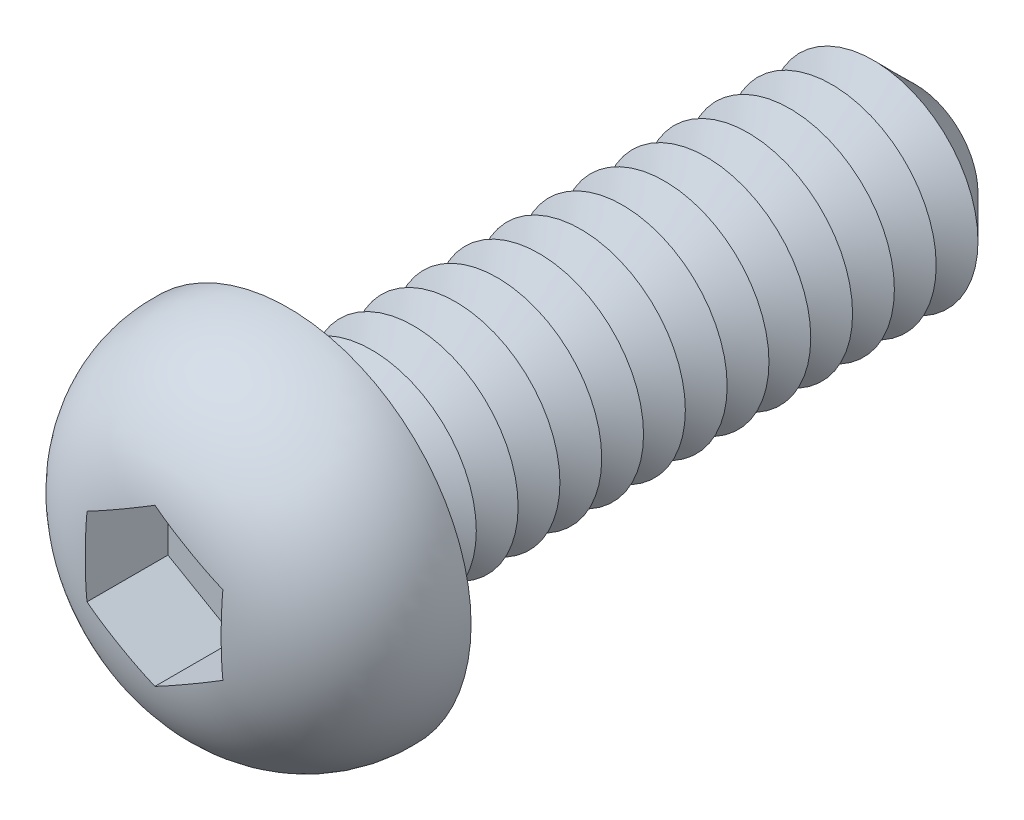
ISO-10303-21;
HEADER;
FILE_DESCRIPTION(('STEP AP214'),'2;1');
FILE_NAME('part.step','',(''),(''),'','','');
FILE_SCHEMA(('AUTOMOTIVE_DESIGN { 1 0 10303 214 1 1 1 1 }'));
ENDSEC;
DATA;
#1=APPLICATION_CONTEXT('core data for automotive mechanical design processes');
#2=APPLICATION_PROTOCOL_DEFINITION('international standard','automotive_design',2000,#1);
#3=PRODUCT_CONTEXT('',#1,'mechanical');
#4=PRODUCT('Part','Part','',(#3));
#5=PRODUCT_RELATED_PRODUCT_CATEGORY('part','',(#4));
#6=PRODUCT_DEFINITION_FORMATION('','',#4);
#7=PRODUCT_DEFINITION_CONTEXT('part definition',#1,'design');
#8=PRODUCT_DEFINITION('design','',#6,#7);
#9=PRODUCT_DEFINITION_SHAPE('','',#8);
#10=(LENGTH_UNIT() NAMED_UNIT(*) SI_UNIT(.MILLI.,.METRE.));
#11=(NAMED_UNIT(*) PLANE_ANGLE_UNIT() SI_UNIT($,.RADIAN.));
#12=(NAMED_UNIT(*) SI_UNIT($,.STERADIAN.) SOLID_ANGLE_UNIT());
#13=UNCERTAINTY_MEASURE_WITH_UNIT(LENGTH_MEASURE(1.E-05),#10,'distance_accuracy_value','');
#14=(GEOMETRIC_REPRESENTATION_CONTEXT(3) GLOBAL_UNCERTAINTY_ASSIGNED_CONTEXT((#13)) GLOBAL_UNIT_ASSIGNED_CONTEXT((#10,
#11,#12)) REPRESENTATION_CONTEXT('',''));
#15=CARTESIAN_POINT('',(0.,0.,0.));
#16=DIRECTION('',(0.,0.,1.));
#17=DIRECTION('',(1.,0.,0.));
#18=AXIS2_PLACEMENT_3D('',#15,#16,#17);
#19=CARTESIAN_POINT('',(0.,0.,-6.));
#20=DIRECTION('',(0.,0.,1.));
#21=DIRECTION('',(1.,0.,0.));
#22=AXIS2_PLACEMENT_3D('',#19,#20,#21);
#23=CYLINDRICAL_SURFACE('',#22,1.);
#24=CARTESIAN_POINT('',(0.,0.,-0.2));
#25=DIRECTION('',(0.,0.,1.));
#26=DIRECTION('',(1.,0.,0.));
#27=AXIS2_PLACEMENT_3D('',#24,#25,#26);
#28=CIRCLE('',#27,1.);
#29=CARTESIAN_POINT('',(1.,0.,-0.2));
#30=VERTEX_POINT('',#29);
#31=EDGE_CURVE('E48',#30,#30,#28,.F.);
#32=ORIENTED_EDGE('',*,*,#31,.T.);
#33=EDGE_LOOP('',(#32));
#34=FACE_BOUND('',#33,.T.);
#35=CARTESIAN_POINT('',(0.,0.,-0.399999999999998));
#36=DIRECTION('',(0.,0.,1.));
#37=DIRECTION('',(1.,0.,0.));
#38=AXIS2_PLACEMENT_3D('',#35,#36,#37);
#39=CIRCLE('',#38,1.);
#40=CARTESIAN_POINT('',(1.,0.,-0.399999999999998));
#41=VERTEX_POINT('',#40);
#42=EDGE_CURVE('E118',#41,#41,#39,.T.);
#43=ORIENTED_EDGE('',*,*,#42,.T.);
#44=EDGE_LOOP('',(#43));
#45=FACE_BOUND('',#44,.T.);
#46=ADVANCED_FACE('F39',(#34,#45),#23,.T.);
#47=CARTESIAN_POINT('',(0.,1.75,0.));
#48=DIRECTION('',(0.,0.,1.));
#49=DIRECTION('',(1.,0.,0.));
#50=AXIS2_PLACEMENT_3D('',#47,#48,#49);
#51=PLANE('',#50);
#52=CARTESIAN_POINT('',(0.,0.,0.));
#53=DIRECTION('',(0.,0.,1.));
#54=DIRECTION('',(1.,0.,0.));
#55=AXIS2_PLACEMENT_3D('',#52,#53,#54);
#56=CIRCLE('',#55,1.2);
#57=CARTESIAN_POINT('',(1.2,0.,0.));
#58=VERTEX_POINT('',#57);
#59=EDGE_CURVE('E11',#58,#58,#56,.T.);
#60=ORIENTED_EDGE('',*,*,#59,.T.);
#61=EDGE_LOOP('',(#60));
#62=FACE_BOUND('',#61,.T.);
#63=CARTESIAN_POINT('',(0.,0.,0.));
#64=DIRECTION('',(0.,0.,1.));
#65=DIRECTION('',(1.,0.,0.));
#66=AXIS2_PLACEMENT_3D('',#63,#64,#65);
#67=CIRCLE('',#66,1.75);
#68=CARTESIAN_POINT('',(1.75,0.,0.));
#69=VERTEX_POINT('',#68);
#70=EDGE_CURVE('E141',#69,#69,#67,.T.);
#71=ORIENTED_EDGE('',*,*,#70,.F.);
#72=EDGE_LOOP('',(#71));
#73=FACE_BOUND('',#72,.T.);
#74=ADVANCED_FACE('F217',(#62,#73),#51,.F.);
#75=CARTESIAN_POINT('',(0.,0.,0.0499999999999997));
#76=DIRECTION('',(0.,0.,1.));
#77=DIRECTION('',(1.,0.,0.));
#78=AXIS2_PLACEMENT_3D('',#75,#76,#77);
#79=DEGENERATE_TOROIDAL_SURFACE('',#78,0.50100040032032,1.25,.T.);
#80=CARTESIAN_POINT('',(-0.6502,0.375162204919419,1.2748120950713));
#81=CARTESIAN_POINT('',(-0.623166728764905,0.390769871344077,1.27799168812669));
#82=CARTESIAN_POINT('',(-0.596087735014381,0.406403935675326,1.28057383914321));
#83=CARTESIAN_POINT('',(-0.541883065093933,0.437699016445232,1.28476453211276));
#84=CARTESIAN_POINT('',(-0.514757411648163,0.453360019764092,1.28637345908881));
#85=CARTESIAN_POINT('',(-0.460533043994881,0.484666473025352,1.288838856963));
#86=CARTESIAN_POINT('',(-0.433434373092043,0.500311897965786,1.28969671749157));
#87=CARTESIAN_POINT('',(-0.379223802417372,0.531610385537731,1.29082127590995));
#88=CARTESIAN_POINT('',(-0.352111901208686,0.547263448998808,1.29108787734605));
#89=CARTESIAN_POINT('',(-0.297888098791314,0.578569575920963,1.29108787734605));
#90=CARTESIAN_POINT('',(-0.270776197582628,0.59422263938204,1.29082127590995));
#91=CARTESIAN_POINT('',(-0.216565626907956,0.625521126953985,1.28969671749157));
#92=CARTESIAN_POINT('',(-0.189466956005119,0.641166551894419,1.288838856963));
#93=CARTESIAN_POINT('',(-0.135242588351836,0.672473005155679,1.28637345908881));
#94=CARTESIAN_POINT('',(-0.108116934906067,0.688134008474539,1.28476453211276));
#95=CARTESIAN_POINT('',(-0.0539122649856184,0.719429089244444,1.28057383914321));
#96=CARTESIAN_POINT('',(-0.0268332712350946,0.735063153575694,1.27799168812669));
#97=CARTESIAN_POINT('',(0.000200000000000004,0.750670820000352,1.2748120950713));
#98=B_SPLINE_CURVE_WITH_KNOTS('',3,(#80,#81,#82,#83,#84,#85,#86,#87,#88,#89,#90,#91,#92,#93,#94,
#95,#96,#97),.UNSPECIFIED.,.F.,.F.,(4,2,2,2,2,2,2,2,4),(0.,0.0941133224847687,0.188189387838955,
0.282091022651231,0.376007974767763,0.469924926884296,0.563826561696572,0.657902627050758,
0.752015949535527),.UNSPECIFIED.);
#99=CARTESIAN_POINT('',(-0.65,0.375277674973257,1.27483563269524));
#100=VERTEX_POINT('',#99);
#101=CARTESIAN_POINT('',(0.,0.750555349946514,1.27483563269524));
#102=VERTEX_POINT('',#101);
#103=EDGE_CURVE('E158',#100,#102,#98,.T.);
#104=ORIENTED_EDGE('',*,*,#103,.T.);
#105=CARTESIAN_POINT('',(-0.000199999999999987,0.750670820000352,1.2748120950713));
#106=CARTESIAN_POINT('',(0.0268332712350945,0.735063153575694,1.27799168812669));
#107=CARTESIAN_POINT('',(0.0539122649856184,0.719429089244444,1.28057383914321));
#108=CARTESIAN_POINT('',(0.108116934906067,0.688134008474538,1.28476453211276));
#109=CARTESIAN_POINT('',(0.135242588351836,0.672473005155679,1.28637345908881));
#110=CARTESIAN_POINT('',(0.189466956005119,0.641166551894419,1.288838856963));
#111=CARTESIAN_POINT('',(0.216565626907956,0.625521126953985,1.28969671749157));
#112=CARTESIAN_POINT('',(0.270776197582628,0.59422263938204,1.29082127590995));
#113=CARTESIAN_POINT('',(0.297888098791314,0.578569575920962,1.29108787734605));
#114=CARTESIAN_POINT('',(0.352111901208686,0.547263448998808,1.29108787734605));
#115=CARTESIAN_POINT('',(0.379223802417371,0.531610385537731,1.29082127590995));
#116=CARTESIAN_POINT('',(0.433434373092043,0.500311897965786,1.28969671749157));
#117=CARTESIAN_POINT('',(0.46053304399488,0.484666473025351,1.288838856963));
#118=CARTESIAN_POINT('',(0.514757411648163,0.453360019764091,1.28637345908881));
#119=CARTESIAN_POINT('',(0.541883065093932,0.437699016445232,1.28476453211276));
#120=CARTESIAN_POINT('',(0.596087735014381,0.406403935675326,1.28057383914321));
#121=CARTESIAN_POINT('',(0.623166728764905,0.390769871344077,1.27799168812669));
#122=CARTESIAN_POINT('',(0.6502,0.375162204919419,1.2748120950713));
#123=B_SPLINE_CURVE_WITH_KNOTS('',3,(#105,#106,#107,#108,#109,#110,#111,#112,#113,#114,#115,
#116,#117,#118,#119,#120,#121,#122),.UNSPECIFIED.,.F.,.F.,(4,2,2,2,2,2,2,2,4),(0.,
0.0941133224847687,0.188189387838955,0.282091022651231,0.376007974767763,0.469924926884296,
0.563826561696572,0.657902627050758,0.752015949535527),.UNSPECIFIED.);
#124=CARTESIAN_POINT('',(0.65,0.375277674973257,1.27483563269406));
#125=VERTEX_POINT('',#124);
#126=EDGE_CURVE('E98',#102,#125,#123,.T.);
#127=ORIENTED_EDGE('',*,*,#126,.T.);
#128=CARTESIAN_POINT('',(0.65,0.,1.29108787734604));
#129=CARTESIAN_POINT('',(0.65,-0.0548046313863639,1.29109436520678));
#130=CARTESIAN_POINT('',(0.65,-0.109608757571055,1.29030350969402));
#131=CARTESIAN_POINT('',(0.65,-0.219170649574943,1.28661520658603));
#132=CARTESIAN_POINT('',(0.65,-0.273928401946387,1.28371727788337));
#133=CARTESIAN_POINT('',(0.65,-0.383095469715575,1.27460340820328));
#134=CARTESIAN_POINT('',(0.65,-0.437505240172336,1.26839356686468));
#135=CARTESIAN_POINT('',(0.65,-0.545599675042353,1.25147686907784));
#136=CARTESIAN_POINT('',(0.65,-0.599284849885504,1.24077336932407));
#137=CARTESIAN_POINT('',(0.65,-0.726147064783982,1.20871234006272));
#138=CARTESIAN_POINT('',(0.65,-0.79872007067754,1.18482363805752));
#139=CARTESIAN_POINT('',(0.65,-0.939044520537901,1.12544321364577));
#140=CARTESIAN_POINT('',(0.65,-1.00679500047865,1.08994917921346));
#141=CARTESIAN_POINT('',(0.65,-1.13535055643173,1.00723279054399));
#142=CARTESIAN_POINT('',(0.65,-1.19611172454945,0.959941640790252));
#143=CARTESIAN_POINT('',(0.65,-1.30775435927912,0.854818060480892));
#144=CARTESIAN_POINT('',(0.65,-1.35863681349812,0.796986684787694));
#145=CARTESIAN_POINT('',(0.65,-1.44408820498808,0.678594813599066));
#146=CARTESIAN_POINT('',(0.65,-1.4797502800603,0.618820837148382));
#147=CARTESIAN_POINT('',(0.65,-1.53998909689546,0.493937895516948));
#148=CARTESIAN_POINT('',(0.65,-1.56457069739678,0.428831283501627));
#149=CARTESIAN_POINT('',(0.65,-1.60096350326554,0.298259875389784));
#150=CARTESIAN_POINT('',(0.65,-1.61329238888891,0.232938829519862));
#151=CARTESIAN_POINT('',(0.65,-1.62664623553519,0.101147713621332));
#152=CARTESIAN_POINT('',(0.65,-1.6276715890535,0.0346776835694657));
#153=CARTESIAN_POINT('',(0.65,-1.6184464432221,-0.0965779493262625));
#154=CARTESIAN_POINT('',(0.65,-1.60834630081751,-0.161374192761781));
#155=CARTESIAN_POINT('',(0.65,-1.57743533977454,-0.288341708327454));
#156=CARTESIAN_POINT('',(0.65,-1.55662692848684,-0.350513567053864));
#157=CARTESIAN_POINT('',(0.65,-1.50490327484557,-0.470651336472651));
#158=CARTESIAN_POINT('',(0.65,-1.47396668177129,-0.528608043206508));
#159=CARTESIAN_POINT('',(0.65,-1.40295285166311,-0.63865943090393));
#160=CARTESIAN_POINT('',(0.65,-1.36286988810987,-0.690750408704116));
#161=CARTESIAN_POINT('',(0.65,-1.27395593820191,-0.788697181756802));
#162=CARTESIAN_POINT('',(0.65,-1.22497034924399,-0.834412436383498));
#163=CARTESIAN_POINT('',(0.65,-1.12042496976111,-0.917345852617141));
#164=CARTESIAN_POINT('',(0.65,-1.06487498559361,-0.954576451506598));
#165=CARTESIAN_POINT('',(0.65,-0.945822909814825,-1.02180899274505));
#166=CARTESIAN_POINT('',(0.65,-0.882060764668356,-1.05135028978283));
#167=CARTESIAN_POINT('',(0.65,-0.783687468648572,-1.08845195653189));
#168=CARTESIAN_POINT('',(0.65,-0.750379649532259,-1.09963089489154));
#169=CARTESIAN_POINT('',(0.65,-0.683093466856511,-1.11968224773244));
#170=CARTESIAN_POINT('',(0.65,-0.64911549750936,-1.12855597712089));
#171=CARTESIAN_POINT('',(0.65,-0.573025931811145,-1.14591124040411));
#172=CARTESIAN_POINT('',(0.65,-0.530794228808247,-1.15386155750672));
#173=CARTESIAN_POINT('',(0.65,-0.445896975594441,-1.16700727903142));
#174=CARTESIAN_POINT('',(0.65,-0.40323122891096,-1.17220137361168));
#175=CARTESIAN_POINT('',(0.65,-0.317562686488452,-1.18041063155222));
#176=CARTESIAN_POINT('',(0.65,-0.274559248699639,-1.18341875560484));
#177=CARTESIAN_POINT('',(0.65,-0.188468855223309,-1.18783962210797));
#178=CARTESIAN_POINT('',(0.65,-0.145381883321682,-1.1892520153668));
#179=CARTESIAN_POINT('',(0.65,-0.0590019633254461,-1.19095450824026));
#180=CARTESIAN_POINT('',(0.65,-0.0157089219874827,-1.19123978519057));
#181=CARTESIAN_POINT('',(0.65,0.0708684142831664,-1.1907952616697));
#182=CARTESIAN_POINT('',(0.65,0.114152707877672,-1.19006535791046));
#183=CARTESIAN_POINT('',(0.65,0.243756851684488,-1.18593769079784));
#184=CARTESIAN_POINT('',(0.65,0.330069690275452,-1.18060873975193));
#185=CARTESIAN_POINT('',(0.65,0.455654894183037,-1.16558903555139));
#186=CARTESIAN_POINT('',(0.65,0.495371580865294,-1.1597609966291));
#187=CARTESIAN_POINT('',(0.65,0.574346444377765,-1.14554740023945));
#188=CARTESIAN_POINT('',(0.65,0.613604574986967,-1.13716158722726));
#189=CARTESIAN_POINT('',(0.65,0.729813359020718,-1.10777161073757));
#190=CARTESIAN_POINT('',(0.65,0.805761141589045,-1.0824785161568));
#191=CARTESIAN_POINT('',(0.65,0.953092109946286,-1.01876094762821));
#192=CARTESIAN_POINT('',(0.65,1.02440985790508,-0.980183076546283));
#193=CARTESIAN_POINT('',(0.65,1.15871394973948,-0.890064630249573));
#194=CARTESIAN_POINT('',(0.65,1.22167627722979,-0.838487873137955));
#195=CARTESIAN_POINT('',(0.65,1.330165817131,-0.729868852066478));
#196=CARTESIAN_POINT('',(0.649999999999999,1.37682604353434,-0.673955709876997));
#197=CARTESIAN_POINT('',(0.649999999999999,1.45915796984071,-0.554638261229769));
#198=CARTESIAN_POINT('',(0.649999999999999,1.49484555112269,-0.491244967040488));
#199=CARTESIAN_POINT('',(0.649999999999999,1.55177809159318,-0.363813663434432));
#200=CARTESIAN_POINT('',(0.649999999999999,1.57388655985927,-0.300159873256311));
#201=CARTESIAN_POINT('',(0.649999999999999,1.60682450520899,-0.169982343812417));
#202=CARTESIAN_POINT('',(0.649999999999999,1.61765327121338,-0.103458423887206));
#203=CARTESIAN_POINT('',(0.649999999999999,1.62754441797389,0.0288862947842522));
#204=CARTESIAN_POINT('',(0.649999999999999,1.6268761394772,0.0946871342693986));
#205=CARTESIAN_POINT('',(0.649999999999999,1.61445465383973,0.225228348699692));
#206=CARTESIAN_POINT('',(0.649999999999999,1.60270257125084,0.289968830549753));
#207=CARTESIAN_POINT('',(0.649999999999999,1.56855547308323,0.416311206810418));
#208=CARTESIAN_POINT('',(0.649999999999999,1.54620091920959,0.477924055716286));
#209=CARTESIAN_POINT('',(0.649999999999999,1.49157336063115,0.596573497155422));
#210=CARTESIAN_POINT('',(0.649999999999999,1.459300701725,0.6536102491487));
#211=CARTESIAN_POINT('',(0.649999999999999,1.38544036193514,0.762206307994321));
#212=CARTESIAN_POINT('',(0.65,1.34375441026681,0.813698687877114));
#213=CARTESIAN_POINT('',(0.65,1.25257593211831,0.909229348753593));
#214=CARTESIAN_POINT('',(0.65,1.20308164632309,0.953265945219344));
#215=CARTESIAN_POINT('',(0.65,1.09600377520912,1.03435686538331));
#216=CARTESIAN_POINT('',(0.65,1.0382019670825,1.07112203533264));
#217=CARTESIAN_POINT('',(0.65,0.917680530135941,1.13527918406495));
#218=CARTESIAN_POINT('',(0.65,0.854963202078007,1.16267551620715));
#219=CARTESIAN_POINT('',(0.65,0.743153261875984,1.20242953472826));
#220=CARTESIAN_POINT('',(0.65,0.69477028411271,1.21684578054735));
#221=CARTESIAN_POINT('',(0.65,0.596867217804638,1.24115086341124));
#222=CARTESIAN_POINT('',(0.65,0.547346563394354,1.25103739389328));
#223=CARTESIAN_POINT('',(0.65,0.397729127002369,1.27492295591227));
#224=CARTESIAN_POINT('',(0.65,0.296733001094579,1.28309757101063));
#225=CARTESIAN_POINT('',(0.65,0.163130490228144,1.28863783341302));
#226=CARTESIAN_POINT('',(0.65,0.130510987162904,1.28957449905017));
#227=CARTESIAN_POINT('',(0.65,0.0652609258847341,1.29079749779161));
#228=CARTESIAN_POINT('',(0.65,0.0326303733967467,1.29108401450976));
#229=CARTESIAN_POINT('',(0.65,0.,1.29108787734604));
#230=B_SPLINE_CURVE_WITH_KNOTS('',3,(#128,#129,#130,#131,#132,#133,#134,#135,#136,#137,#138,
#139,#140,#141,#142,#143,#144,#145,#146,#147,#148,#149,#150,#151,#152,#153,#154,#155,#156,#157,
#158,#159,#160,#161,#162,#163,#164,#165,#166,#167,#168,#169,#170,#171,#172,#173,#174,#175,#176,
#177,#178,#179,#180,#181,#182,#183,#184,#185,#186,#187,#188,#189,#190,#191,#192,#193,#194,#195,
#196,#197,#198,#199,#200,#201,#202,#203,#204,#205,#206,#207,#208,#209,#210,#211,#212,#213,#214,
#215,#216,#217,#218,#219,#220,#221,#222,#223,#224,#225,#226,#227,#228,#229),.UNSPECIFIED.,.T.,
.F.,(4,2,2,2,2,2,2,2,2,2,2,2,2,2,2,2,2,2,2,2,2,2,2,2,2,2,2,2,2,2,2,2,2,2,2,2,2,2,2,2,2,2,2,2,2,
2,2,2,2,2,4),(0.,0.164404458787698,0.328846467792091,0.492986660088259,0.657004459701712,
0.885283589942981,1.11360822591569,1.34329681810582,1.57296243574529,1.78072081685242,
1.9883880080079,2.18685176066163,2.38530862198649,2.58111595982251,2.77687929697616,
2.97305799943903,3.16935986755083,3.36946935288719,3.5692835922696,3.77920028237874,
3.88453412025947,3.98980774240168,4.11861722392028,4.24748786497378,4.37677168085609,
4.50608378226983,4.63594858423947,4.76582660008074,5.02485743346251,5.14520715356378,
5.26556890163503,5.5046106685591,5.74651068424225,5.98909160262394,6.20640136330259,
6.42339510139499,6.62456294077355,6.82574346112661,7.02221748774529,7.21867158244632,
7.41438191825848,7.61008543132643,7.80793510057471,8.00582941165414,8.21046898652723,
8.41501334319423,8.56624321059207,8.71754999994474,9.02064941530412,9.11856257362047,
9.21644807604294),.UNSPECIFIED.);
#231=CARTESIAN_POINT('',(0.65,-0.375277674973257,1.27483563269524));
#232=VERTEX_POINT('',#231);
#233=EDGE_CURVE('E63',#125,#232,#230,.T.);
#234=ORIENTED_EDGE('',*,*,#233,.T.);
#235=CARTESIAN_POINT('',(0.6502,-0.375162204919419,1.2748120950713));
#236=CARTESIAN_POINT('',(0.623166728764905,-0.390769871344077,1.27799168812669));
#237=CARTESIAN_POINT('',(0.596087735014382,-0.406403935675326,1.28057383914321));
#238=CARTESIAN_POINT('',(0.541883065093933,-0.437699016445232,1.28476453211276));
#239=CARTESIAN_POINT('',(0.514757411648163,-0.453360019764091,1.28637345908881));
#240=CARTESIAN_POINT('',(0.460533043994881,-0.484666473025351,1.288838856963));
#241=CARTESIAN_POINT('',(0.433434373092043,-0.500311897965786,1.28969671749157));
#242=CARTESIAN_POINT('',(0.379223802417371,-0.531610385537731,1.29082127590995));
#243=CARTESIAN_POINT('',(0.352111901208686,-0.547263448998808,1.29108787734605));
#244=CARTESIAN_POINT('',(0.297888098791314,-0.578569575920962,1.29108787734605));
#245=CARTESIAN_POINT('',(0.270776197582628,-0.59422263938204,1.29082127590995));
#246=CARTESIAN_POINT('',(0.216565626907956,-0.625521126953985,1.28969671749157));
#247=CARTESIAN_POINT('',(0.189466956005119,-0.641166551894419,1.288838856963));
#248=CARTESIAN_POINT('',(0.135242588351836,-0.672473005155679,1.28637345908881));
#249=CARTESIAN_POINT('',(0.108116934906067,-0.688134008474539,1.28476453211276));
#250=CARTESIAN_POINT('',(0.0539122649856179,-0.719429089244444,1.28057383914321));
#251=CARTESIAN_POINT('',(0.026833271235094,-0.735063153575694,1.27799168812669));
#252=CARTESIAN_POINT('',(-0.000200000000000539,-0.750670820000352,1.2748120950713));
#253=B_SPLINE_CURVE_WITH_KNOTS('',3,(#235,#236,#237,#238,#239,#240,#241,#242,#243,#244,#245,
#246,#247,#248,#249,#250,#251,#252),.UNSPECIFIED.,.F.,.F.,(4,2,2,2,2,2,2,2,4),(0.,
0.0941133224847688,0.188189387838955,0.282091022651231,0.376007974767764,0.469924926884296,
0.563826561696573,0.657902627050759,0.752015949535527),.UNSPECIFIED.);
#254=CARTESIAN_POINT('',(0.,-0.750555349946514,1.27483563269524));
#255=VERTEX_POINT('',#254);
#256=EDGE_CURVE('E238',#232,#255,#253,.T.);
#257=ORIENTED_EDGE('',*,*,#256,.T.);
#258=CARTESIAN_POINT('',(0.000199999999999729,-0.750670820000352,1.2748120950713));
#259=CARTESIAN_POINT('',(-0.0268332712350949,-0.735063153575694,1.27799168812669));
#260=CARTESIAN_POINT('',(-0.0539122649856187,-0.719429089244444,1.28057383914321));
#261=CARTESIAN_POINT('',(-0.108116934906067,-0.688134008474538,1.28476453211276));
#262=CARTESIAN_POINT('',(-0.135242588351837,-0.672473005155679,1.28637345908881));
#263=CARTESIAN_POINT('',(-0.18946695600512,-0.641166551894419,1.288838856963));
#264=CARTESIAN_POINT('',(-0.216565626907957,-0.625521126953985,1.28969671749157));
#265=CARTESIAN_POINT('',(-0.270776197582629,-0.59422263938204,1.29082127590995));
#266=CARTESIAN_POINT('',(-0.297888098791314,-0.578569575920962,1.29108787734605));
#267=CARTESIAN_POINT('',(-0.352111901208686,-0.547263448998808,1.29108787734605));
#268=CARTESIAN_POINT('',(-0.379223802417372,-0.531610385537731,1.29082127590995));
#269=CARTESIAN_POINT('',(-0.433434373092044,-0.500311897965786,1.28969671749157));
#270=CARTESIAN_POINT('',(-0.460533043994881,-0.484666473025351,1.288838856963));
#271=CARTESIAN_POINT('',(-0.514757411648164,-0.453360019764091,1.28637345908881));
#272=CARTESIAN_POINT('',(-0.541883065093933,-0.437699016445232,1.28476453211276));
#273=CARTESIAN_POINT('',(-0.596087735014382,-0.406403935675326,1.28057383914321));
#274=CARTESIAN_POINT('',(-0.623166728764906,-0.390769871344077,1.27799168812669));
#275=CARTESIAN_POINT('',(-0.6502,-0.375162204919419,1.2748120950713));
#276=B_SPLINE_CURVE_WITH_KNOTS('',3,(#258,#259,#260,#261,#262,#263,#264,#265,#266,#267,#268,
#269,#270,#271,#272,#273,#274,#275),.UNSPECIFIED.,.F.,.F.,(4,2,2,2,2,2,2,2,4),(0.,
0.0941133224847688,0.188189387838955,0.282091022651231,0.376007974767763,0.469924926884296,
0.563826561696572,0.657902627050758,0.752015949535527),.UNSPECIFIED.);
#277=CARTESIAN_POINT('',(-0.65,-0.375277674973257,1.27483563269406));
#278=VERTEX_POINT('',#277);
#279=EDGE_CURVE('E244',#255,#278,#276,.T.);
#280=ORIENTED_EDGE('',*,*,#279,.T.);
#281=CARTESIAN_POINT('',(-0.65,0.,1.29108787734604));
#282=CARTESIAN_POINT('',(-0.65,0.0548046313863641,1.29109436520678));
#283=CARTESIAN_POINT('',(-0.65,0.109608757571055,1.29030350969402));
#284=CARTESIAN_POINT('',(-0.65,0.219170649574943,1.28661520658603));
#285=CARTESIAN_POINT('',(-0.65,0.273928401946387,1.28371727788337));
#286=CARTESIAN_POINT('',(-0.65,0.383095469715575,1.27460340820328));
#287=CARTESIAN_POINT('',(-0.65,0.437505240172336,1.26839356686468));
#288=CARTESIAN_POINT('',(-0.65,0.545599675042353,1.25147686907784));
#289=CARTESIAN_POINT('',(-0.65,0.599284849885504,1.24077336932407));
#290=CARTESIAN_POINT('',(-0.65,0.726147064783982,1.20871234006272));
#291=CARTESIAN_POINT('',(-0.65,0.79872007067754,1.18482363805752));
#292=CARTESIAN_POINT('',(-0.65,0.939044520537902,1.12544321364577));
#293=CARTESIAN_POINT('',(-0.65,1.00679500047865,1.08994917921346));
#294=CARTESIAN_POINT('',(-0.65,1.13535055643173,1.00723279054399));
#295=CARTESIAN_POINT('',(-0.65,1.19611172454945,0.959941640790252));
#296=CARTESIAN_POINT('',(-0.65,1.30775435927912,0.854818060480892));
#297=CARTESIAN_POINT('',(-0.649999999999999,1.35863681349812,0.796986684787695));
#298=CARTESIAN_POINT('',(-0.649999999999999,1.44408820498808,0.678594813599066));
#299=CARTESIAN_POINT('',(-0.649999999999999,1.4797502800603,0.618820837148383));
#300=CARTESIAN_POINT('',(-0.649999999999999,1.53998909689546,0.493937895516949));
#301=CARTESIAN_POINT('',(-0.649999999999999,1.56457069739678,0.428831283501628));
#302=CARTESIAN_POINT('',(-0.649999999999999,1.60096350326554,0.298259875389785));
#303=CARTESIAN_POINT('',(-0.649999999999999,1.61329238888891,0.232938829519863));
#304=CARTESIAN_POINT('',(-0.649999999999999,1.62664623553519,0.101147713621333));
#305=CARTESIAN_POINT('',(-0.649999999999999,1.6276715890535,0.0346776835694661));
#306=CARTESIAN_POINT('',(-0.649999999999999,1.6184464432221,-0.0965779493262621));
#307=CARTESIAN_POINT('',(-0.649999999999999,1.60834630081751,-0.16137419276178));
#308=CARTESIAN_POINT('',(-0.649999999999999,1.57743533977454,-0.288341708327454));
#309=CARTESIAN_POINT('',(-0.649999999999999,1.55662692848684,-0.350513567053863));
#310=CARTESIAN_POINT('',(-0.649999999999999,1.50490327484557,-0.47065133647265));
#311=CARTESIAN_POINT('',(-0.649999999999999,1.47396668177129,-0.528608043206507));
#312=CARTESIAN_POINT('',(-0.649999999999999,1.40295285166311,-0.638659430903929));
#313=CARTESIAN_POINT('',(-0.649999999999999,1.36286988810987,-0.690750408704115));
#314=CARTESIAN_POINT('',(-0.649999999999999,1.27395593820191,-0.788697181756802));
#315=CARTESIAN_POINT('',(-0.65,1.22497034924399,-0.834412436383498));
#316=CARTESIAN_POINT('',(-0.65,1.12042496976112,-0.91734585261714));
#317=CARTESIAN_POINT('',(-0.65,1.06487498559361,-0.954576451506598));
#318=CARTESIAN_POINT('',(-0.65,0.945822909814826,-1.02180899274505));
#319=CARTESIAN_POINT('',(-0.65,0.882060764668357,-1.05135028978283));
#320=CARTESIAN_POINT('',(-0.65,0.783687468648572,-1.08845195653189));
#321=CARTESIAN_POINT('',(-0.65,0.75037964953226,-1.09963089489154));
#322=CARTESIAN_POINT('',(-0.65,0.683093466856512,-1.11968224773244));
#323=CARTESIAN_POINT('',(-0.65,0.649115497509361,-1.12855597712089));
#324=CARTESIAN_POINT('',(-0.65,0.573025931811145,-1.14591124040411));
#325=CARTESIAN_POINT('',(-0.65,0.530794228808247,-1.15386155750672));
#326=CARTESIAN_POINT('',(-0.65,0.445896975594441,-1.16700727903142));
#327=CARTESIAN_POINT('',(-0.65,0.40323122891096,-1.17220137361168));
#328=CARTESIAN_POINT('',(-0.65,0.317562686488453,-1.18041063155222));
#329=CARTESIAN_POINT('',(-0.65,0.27455924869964,-1.18341875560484));
#330=CARTESIAN_POINT('',(-0.65,0.18846885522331,-1.18783962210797));
#331=CARTESIAN_POINT('',(-0.65,0.145381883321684,-1.1892520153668));
#332=CARTESIAN_POINT('',(-0.65,0.0590019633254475,-1.19095450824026));
#333=CARTESIAN_POINT('',(-0.65,0.0157089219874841,-1.19123978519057));
#334=CARTESIAN_POINT('',(-0.65,-0.070868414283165,-1.1907952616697));
#335=CARTESIAN_POINT('',(-0.65,-0.114152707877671,-1.19006535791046));
#336=CARTESIAN_POINT('',(-0.65,-0.243756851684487,-1.18593769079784));
#337=CARTESIAN_POINT('',(-0.65,-0.330069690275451,-1.18060873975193));
#338=CARTESIAN_POINT('',(-0.65,-0.455654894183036,-1.16558903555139));
#339=CARTESIAN_POINT('',(-0.65,-0.495371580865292,-1.1597609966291));
#340=CARTESIAN_POINT('',(-0.65,-0.574346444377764,-1.14554740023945));
#341=CARTESIAN_POINT('',(-0.65,-0.613604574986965,-1.13716158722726));
#342=CARTESIAN_POINT('',(-0.65,-0.729813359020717,-1.10777161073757));
#343=CARTESIAN_POINT('',(-0.65,-0.805761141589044,-1.0824785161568));
#344=CARTESIAN_POINT('',(-0.65,-0.953092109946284,-1.01876094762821));
#345=CARTESIAN_POINT('',(-0.65,-1.02440985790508,-0.980183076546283));
#346=CARTESIAN_POINT('',(-0.65,-1.15871394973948,-0.890064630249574));
#347=CARTESIAN_POINT('',(-0.65,-1.22167627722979,-0.838487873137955));
#348=CARTESIAN_POINT('',(-0.65,-1.330165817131,-0.729868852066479));
#349=CARTESIAN_POINT('',(-0.65,-1.37682604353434,-0.673955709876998));
#350=CARTESIAN_POINT('',(-0.65,-1.45915796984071,-0.55463826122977));
#351=CARTESIAN_POINT('',(-0.65,-1.49484555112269,-0.49124496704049));
#352=CARTESIAN_POINT('',(-0.65,-1.55177809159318,-0.363813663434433));
#353=CARTESIAN_POINT('',(-0.65,-1.57388655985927,-0.300159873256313));
#354=CARTESIAN_POINT('',(-0.65,-1.60682450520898,-0.169982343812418));
#355=CARTESIAN_POINT('',(-0.65,-1.61765327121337,-0.103458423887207));
#356=CARTESIAN_POINT('',(-0.65,-1.62754441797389,0.0288862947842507));
#357=CARTESIAN_POINT('',(-0.65,-1.6268761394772,0.0946871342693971));
#358=CARTESIAN_POINT('',(-0.65,-1.61445465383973,0.22522834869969));
#359=CARTESIAN_POINT('',(-0.65,-1.60270257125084,0.289968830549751));
#360=CARTESIAN_POINT('',(-0.65,-1.56855547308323,0.416311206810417));
#361=CARTESIAN_POINT('',(-0.65,-1.54620091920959,0.477924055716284));
#362=CARTESIAN_POINT('',(-0.65,-1.49157336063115,0.596573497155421));
#363=CARTESIAN_POINT('',(-0.65,-1.459300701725,0.653610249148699));
#364=CARTESIAN_POINT('',(-0.65,-1.38544036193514,0.762206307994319));
#365=CARTESIAN_POINT('',(-0.65,-1.34375441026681,0.813698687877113));
#366=CARTESIAN_POINT('',(-0.65,-1.25257593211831,0.909229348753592));
#367=CARTESIAN_POINT('',(-0.65,-1.20308164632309,0.953265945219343));
#368=CARTESIAN_POINT('',(-0.65,-1.09600377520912,1.03435686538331));
#369=CARTESIAN_POINT('',(-0.65,-1.0382019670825,1.07112203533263));
#370=CARTESIAN_POINT('',(-0.65,-0.917680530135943,1.13527918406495));
#371=CARTESIAN_POINT('',(-0.65,-0.854963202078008,1.16267551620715));
#372=CARTESIAN_POINT('',(-0.65,-0.743153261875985,1.20242953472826));
#373=CARTESIAN_POINT('',(-0.65,-0.694770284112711,1.21684578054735));
#374=CARTESIAN_POINT('',(-0.65,-0.596867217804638,1.24115086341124));
#375=CARTESIAN_POINT('',(-0.65,-0.547346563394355,1.25103739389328));
#376=CARTESIAN_POINT('',(-0.65,-0.39772912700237,1.27492295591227));
#377=CARTESIAN_POINT('',(-0.65,-0.296733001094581,1.28309757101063));
#378=CARTESIAN_POINT('',(-0.65,-0.163130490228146,1.28863783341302));
#379=CARTESIAN_POINT('',(-0.65,-0.130510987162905,1.28957449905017));
#380=CARTESIAN_POINT('',(-0.65,-0.0652609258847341,1.29079749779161));
#381=CARTESIAN_POINT('',(-0.65,-0.0326303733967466,1.29108401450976));
#382=CARTESIAN_POINT('',(-0.65,0.,1.29108787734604));
#383=B_SPLINE_CURVE_WITH_KNOTS('',3,(#281,#282,#283,#284,#285,#286,#287,#288,#289,#290,#291,
#292,#293,#294,#295,#296,#297,#298,#299,#300,#301,#302,#303,#304,#305,#306,#307,#308,#309,#310,
#311,#312,#313,#314,#315,#316,#317,#318,#319,#320,#321,#322,#323,#324,#325,#326,#327,#328,#329,
#330,#331,#332,#333,#334,#335,#336,#337,#338,#339,#340,#341,#342,#343,#344,#345,#346,#347,#348,
#349,#350,#351,#352,#353,#354,#355,#356,#357,#358,#359,#360,#361,#362,#363,#364,#365,#366,#367,
#368,#369,#370,#371,#372,#373,#374,#375,#376,#377,#378,#379,#380,#381,#382),.UNSPECIFIED.,.T.,
.F.,(4,2,2,2,2,2,2,2,2,2,2,2,2,2,2,2,2,2,2,2,2,2,2,2,2,2,2,2,2,2,2,2,2,2,2,2,2,2,2,2,2,2,2,2,2,
2,2,2,2,2,4),(0.,0.164404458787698,0.328846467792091,0.492986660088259,0.657004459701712,
0.885283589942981,1.11360822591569,1.34329681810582,1.57296243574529,1.78072081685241,
1.9883880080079,2.18685176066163,2.38530862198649,2.58111595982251,2.77687929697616,
2.97305799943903,3.16935986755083,3.36946935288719,3.5692835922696,3.77920028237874,
3.88453412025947,3.98980774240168,4.11861722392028,4.24748786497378,4.37677168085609,
4.50608378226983,4.63594858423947,4.76582660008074,5.02485743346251,5.14520715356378,
5.26556890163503,5.50461066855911,5.74651068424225,5.98909160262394,6.20640136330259,
6.42339510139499,6.62456294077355,6.82574346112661,7.02221748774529,7.21867158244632,
7.41438191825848,7.61008543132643,7.80793510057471,8.00582941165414,8.21046898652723,
8.41501334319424,8.56624321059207,8.71754999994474,9.02064941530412,9.11856257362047,
9.21644807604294),.UNSPECIFIED.);
#384=EDGE_CURVE('E166',#278,#100,#383,.T.);
#385=ORIENTED_EDGE('',*,*,#384,.T.);
#386=EDGE_LOOP('',(#104,#127,#234,#257,#280,#385));
#387=FACE_BOUND('',#386,.T.);
#388=ORIENTED_EDGE('',*,*,#70,.T.);
#389=EDGE_LOOP('',(#388));
#390=FACE_BOUND('',#389,.T.);
#391=ADVANCED_FACE('F171',(#387,#390),#79,.T.);
#392=CARTESIAN_POINT('',(0.65,0.375277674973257,0.5));
#393=DIRECTION('',(0.5,0.866025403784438,0.));
#394=DIRECTION('',(-0.866025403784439,0.5,0.));
#395=AXIS2_PLACEMENT_3D('',#392,#393,#394);
#396=PLANE('',#395);
#397=DIRECTION('',(0.,0.,1.));
#398=VECTOR('',#397,1.);
#399=CARTESIAN_POINT('',(0.,0.750555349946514,0.5));
#400=LINE('',#399,#398);
#401=CARTESIAN_POINT('',(0.,0.750555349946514,0.5));
#402=VERTEX_POINT('',#401);
#403=EDGE_CURVE('E55',#402,#102,#400,.T.);
#404=ORIENTED_EDGE('',*,*,#403,.F.);
#405=DIRECTION('',(-0.866025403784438,0.5,0.));
#406=VECTOR('',#405,1.);
#407=CARTESIAN_POINT('',(0.65,0.375277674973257,0.5));
#408=LINE('',#407,#406);
#409=CARTESIAN_POINT('',(0.65,0.375277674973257,0.5));
#410=VERTEX_POINT('',#409);
#411=EDGE_CURVE('E95',#410,#402,#408,.T.);
#412=ORIENTED_EDGE('',*,*,#411,.F.);
#413=DIRECTION('',(0.,0.,1.));
#414=VECTOR('',#413,1.);
#415=CARTESIAN_POINT('',(0.65,0.375277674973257,0.5));
#416=LINE('',#415,#414);
#417=EDGE_CURVE('E138',#410,#125,#416,.T.);
#418=ORIENTED_EDGE('',*,*,#417,.T.);
#419=ORIENTED_EDGE('',*,*,#126,.F.);
#420=EDGE_LOOP('',(#404,#412,#418,#419));
#421=FACE_BOUND('',#420,.T.);
#422=ADVANCED_FACE('F93',(#421),#396,.F.);
#423=CARTESIAN_POINT('',(0.65,-0.375277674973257,0.5));
#424=DIRECTION('',(1.,0.,0.));
#425=DIRECTION('',(0.,1.,0.));
#426=AXIS2_PLACEMENT_3D('',#423,#424,#425);
#427=PLANE('',#426);
#428=ORIENTED_EDGE('',*,*,#417,.F.);
#429=DIRECTION('',(0.,1.,0.));
#430=VECTOR('',#429,1.);
#431=CARTESIAN_POINT('',(0.65,-0.375277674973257,0.5));
#432=LINE('',#431,#430);
#433=CARTESIAN_POINT('',(0.65,-0.375277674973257,0.5));
#434=VERTEX_POINT('',#433);
#435=EDGE_CURVE('E102',#434,#410,#432,.T.);
#436=ORIENTED_EDGE('',*,*,#435,.F.);
#437=DIRECTION('',(0.,0.,1.));
#438=VECTOR('',#437,1.);
#439=CARTESIAN_POINT('',(0.65,-0.375277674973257,0.5));
#440=LINE('',#439,#438);
#441=EDGE_CURVE('E142',#434,#232,#440,.T.);
#442=ORIENTED_EDGE('',*,*,#441,.T.);
#443=ORIENTED_EDGE('',*,*,#233,.F.);
#444=EDGE_LOOP('',(#428,#436,#442,#443));
#445=FACE_BOUND('',#444,.T.);
#446=ADVANCED_FACE('F182',(#445),#427,.F.);
#447=CARTESIAN_POINT('',(0.,-0.750555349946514,0.5));
#448=DIRECTION('',(0.5,-0.866025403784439,0.));
#449=DIRECTION('',(0.866025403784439,0.5,0.));
#450=AXIS2_PLACEMENT_3D('',#447,#448,#449);
#451=PLANE('',#450);
#452=ORIENTED_EDGE('',*,*,#441,.F.);
#453=DIRECTION('',(0.866025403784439,0.5,0.));
#454=VECTOR('',#453,1.);
#455=CARTESIAN_POINT('',(0.,-0.750555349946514,0.5));
#456=LINE('',#455,#454);
#457=CARTESIAN_POINT('',(0.,-0.750555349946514,0.5));
#458=VERTEX_POINT('',#457);
#459=EDGE_CURVE('E133',#458,#434,#456,.T.);
#460=ORIENTED_EDGE('',*,*,#459,.F.);
#461=DIRECTION('',(0.,0.,1.));
#462=VECTOR('',#461,1.);
#463=CARTESIAN_POINT('',(0.,-0.750555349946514,0.5));
#464=LINE('',#463,#462);
#465=EDGE_CURVE('E145',#458,#255,#464,.T.);
#466=ORIENTED_EDGE('',*,*,#465,.T.);
#467=ORIENTED_EDGE('',*,*,#256,.F.);
#468=EDGE_LOOP('',(#452,#460,#466,#467));
#469=FACE_BOUND('',#468,.T.);
#470=ADVANCED_FACE('F232',(#469),#451,.F.);
#471=CARTESIAN_POINT('',(-0.65,-0.375277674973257,0.5));
#472=DIRECTION('',(-0.5,-0.866025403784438,0.));
#473=DIRECTION('',(0.866025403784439,-0.5,0.));
#474=AXIS2_PLACEMENT_3D('',#471,#472,#473);
#475=PLANE('',#474);
#476=ORIENTED_EDGE('',*,*,#465,.F.);
#477=DIRECTION('',(0.866025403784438,-0.5,0.));
#478=VECTOR('',#477,1.);
#479=CARTESIAN_POINT('',(-0.65,-0.375277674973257,0.5));
#480=LINE('',#479,#478);
#481=CARTESIAN_POINT('',(-0.65,-0.375277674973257,0.5));
#482=VERTEX_POINT('',#481);
#483=EDGE_CURVE('E129',#482,#458,#480,.T.);
#484=ORIENTED_EDGE('',*,*,#483,.F.);
#485=DIRECTION('',(0.,0.,1.));
#486=VECTOR('',#485,1.);
#487=CARTESIAN_POINT('',(-0.65,-0.375277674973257,0.5));
#488=LINE('',#487,#486);
#489=EDGE_CURVE('E149',#482,#278,#488,.T.);
#490=ORIENTED_EDGE('',*,*,#489,.T.);
#491=ORIENTED_EDGE('',*,*,#279,.F.);
#492=EDGE_LOOP('',(#476,#484,#490,#491));
#493=FACE_BOUND('',#492,.T.);
#494=ADVANCED_FACE('F235',(#493),#475,.F.);
#495=CARTESIAN_POINT('',(-0.65,0.375277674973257,0.5));
#496=DIRECTION('',(-1.,0.,0.));
#497=DIRECTION('',(0.,-1.,0.));
#498=AXIS2_PLACEMENT_3D('',#495,#496,#497);
#499=PLANE('',#498);
#500=ORIENTED_EDGE('',*,*,#489,.F.);
#501=DIRECTION('',(0.,-1.,0.));
#502=VECTOR('',#501,1.);
#503=CARTESIAN_POINT('',(-0.65,0.375277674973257,0.5));
#504=LINE('',#503,#502);
#505=CARTESIAN_POINT('',(-0.65,0.375277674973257,0.5));
#506=VERTEX_POINT('',#505);
#507=EDGE_CURVE('E112',#506,#482,#504,.T.);
#508=ORIENTED_EDGE('',*,*,#507,.F.);
#509=DIRECTION('',(0.,0.,1.));
#510=VECTOR('',#509,1.);
#511=CARTESIAN_POINT('',(-0.65,0.375277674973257,0.5));
#512=LINE('',#511,#510);
#513=EDGE_CURVE('E101',#506,#100,#512,.T.);
#514=ORIENTED_EDGE('',*,*,#513,.T.);
#515=ORIENTED_EDGE('',*,*,#384,.F.);
#516=EDGE_LOOP('',(#500,#508,#514,#515));
#517=FACE_BOUND('',#516,.T.);
#518=ADVANCED_FACE('F177',(#517),#499,.F.);
#519=CARTESIAN_POINT('',(0.,0.750555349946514,0.5));
#520=DIRECTION('',(-0.5,0.866025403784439,0.));
#521=DIRECTION('',(-0.866025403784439,-0.5,0.));
#522=AXIS2_PLACEMENT_3D('',#519,#520,#521);
#523=PLANE('',#522);
#524=ORIENTED_EDGE('',*,*,#513,.F.);
#525=DIRECTION('',(-0.866025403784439,-0.5,0.));
#526=VECTOR('',#525,1.);
#527=CARTESIAN_POINT('',(0.,0.750555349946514,0.5));
#528=LINE('',#527,#526);
#529=EDGE_CURVE('E105',#402,#506,#528,.T.);
#530=ORIENTED_EDGE('',*,*,#529,.F.);
#531=ORIENTED_EDGE('',*,*,#403,.T.);
#532=ORIENTED_EDGE('',*,*,#103,.F.);
#533=EDGE_LOOP('',(#524,#530,#531,#532));
#534=FACE_BOUND('',#533,.T.);
#535=ADVANCED_FACE('F106',(#534),#523,.F.);
#536=CARTESIAN_POINT('',(0.,0.,0.5));
#537=DIRECTION('',(0.,0.,1.));
#538=DIRECTION('',(1.,0.,0.));
#539=AXIS2_PLACEMENT_3D('',#536,#537,#538);
#540=PLANE('',#539);
#541=CARTESIAN_POINT('',(0.,0.,0.5));
#542=DIRECTION('',(0.,0.,1.));
#543=DIRECTION('',(1.,0.,0.));
#544=AXIS2_PLACEMENT_3D('',#541,#542,#543);
#545=CIRCLE('',#544,0.35);
#546=CARTESIAN_POINT('',(0.35,0.,0.5));
#547=VERTEX_POINT('',#546);
#548=EDGE_CURVE('E264',#547,#547,#545,.T.);
#549=ORIENTED_EDGE('',*,*,#548,.F.);
#550=EDGE_LOOP('',(#549));
#551=FACE_BOUND('',#550,.T.);
#552=ORIENTED_EDGE('',*,*,#411,.T.);
#553=ORIENTED_EDGE('',*,*,#529,.T.);
#554=ORIENTED_EDGE('',*,*,#507,.T.);
#555=ORIENTED_EDGE('',*,*,#483,.T.);
#556=ORIENTED_EDGE('',*,*,#459,.T.);
#557=ORIENTED_EDGE('',*,*,#435,.T.);
#558=EDGE_LOOP('',(#552,#553,#554,#555,#556,#557));
#559=FACE_BOUND('',#558,.T.);
#560=ADVANCED_FACE('F114',(#551,#559),#540,.T.);
#561=CARTESIAN_POINT('',(0.,0.,-0.399999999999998));
#562=DIRECTION('',(0.,0.,1.));
#563=DIRECTION('',(1.,0.,0.));
#564=AXIS2_PLACEMENT_3D('',#561,#562,#563);
#565=CONICAL_SURFACE('',#564,1.,1.04719755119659);
#566=CARTESIAN_POINT('',(0.,0.,-0.600000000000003));
#567=DIRECTION('',(0.,0.,1.));
#568=DIRECTION('',(1.,0.,0.));
#569=AXIS2_PLACEMENT_3D('',#566,#567,#568);
#570=CIRCLE('',#569,0.653589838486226);
#571=CARTESIAN_POINT('',(0.653589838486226,0.,-0.600000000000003));
#572=VERTEX_POINT('',#571);
#573=EDGE_CURVE('E123',#572,#572,#570,.T.);
#574=ORIENTED_EDGE('',*,*,#573,.T.);
#575=EDGE_LOOP('',(#574));
#576=FACE_BOUND('',#575,.T.);
#577=ORIENTED_EDGE('',*,*,#42,.F.);
#578=EDGE_LOOP('',(#577));
#579=FACE_BOUND('',#578,.T.);
#580=ADVANCED_FACE('F227',(#576,#579),#565,.T.);
#581=CARTESIAN_POINT('',(0.,0.,-0.600000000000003));
#582=DIRECTION('',(0.,0.,-1.));
#583=DIRECTION('',(-1.,0.,0.));
#584=AXIS2_PLACEMENT_3D('',#581,#582,#583);
#585=CONICAL_SURFACE('',#584,0.653589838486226,1.0471975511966);
#586=CARTESIAN_POINT('',(0.,0.,-0.799999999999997));
#587=DIRECTION('',(0.,0.,1.));
#588=DIRECTION('',(1.,0.,0.));
#589=AXIS2_PLACEMENT_3D('',#586,#587,#588);
#590=CIRCLE('',#589,1.);
#591=CARTESIAN_POINT('',(1.,0.,-0.799999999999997));
#592=VERTEX_POINT('',#591);
#593=EDGE_CURVE('E292',#592,#592,#590,.T.);
#594=ORIENTED_EDGE('',*,*,#593,.T.);
#595=EDGE_LOOP('',(#594));
#596=FACE_BOUND('',#595,.T.);
#597=ORIENTED_EDGE('',*,*,#573,.F.);
#598=EDGE_LOOP('',(#597));
#599=FACE_BOUND('',#598,.T.);
#600=ADVANCED_FACE('F345',(#596,#599),#585,.T.);
#601=CARTESIAN_POINT('',(0.,0.,-0.799999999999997));
#602=DIRECTION('',(0.,0.,1.));
#603=DIRECTION('',(1.,0.,0.));
#604=AXIS2_PLACEMENT_3D('',#601,#602,#603);
#605=CONICAL_SURFACE('',#604,1.,1.04719755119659);
#606=CARTESIAN_POINT('',(0.,0.,-1.));
#607=DIRECTION('',(0.,0.,1.));
#608=DIRECTION('',(1.,0.,0.));
#609=AXIS2_PLACEMENT_3D('',#606,#607,#608);
#610=CIRCLE('',#609,0.653589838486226);
#611=CARTESIAN_POINT('',(0.653589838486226,0.,-1.));
#612=VERTEX_POINT('',#611);
#613=EDGE_CURVE('E290',#612,#612,#610,.T.);
#614=ORIENTED_EDGE('',*,*,#613,.T.);
#615=EDGE_LOOP('',(#614));
#616=FACE_BOUND('',#615,.T.);
#617=ORIENTED_EDGE('',*,*,#593,.F.);
#618=EDGE_LOOP('',(#617));
#619=FACE_BOUND('',#618,.T.);
#620=ADVANCED_FACE('F347',(#616,#619),#605,.T.);
#621=CARTESIAN_POINT('',(0.,0.,-1.));
#622=DIRECTION('',(0.,0.,-1.));
#623=DIRECTION('',(-1.,0.,0.));
#624=AXIS2_PLACEMENT_3D('',#621,#622,#623);
#625=CONICAL_SURFACE('',#624,0.653589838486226,1.0471975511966);
#626=CARTESIAN_POINT('',(0.,0.,-1.2));
#627=DIRECTION('',(0.,0.,1.));
#628=DIRECTION('',(1.,0.,0.));
#629=AXIS2_PLACEMENT_3D('',#626,#627,#628);
#630=CIRCLE('',#629,1.);
#631=CARTESIAN_POINT('',(1.,0.,-1.2));
#632=VERTEX_POINT('',#631);
#633=EDGE_CURVE('E293',#632,#632,#630,.T.);
#634=ORIENTED_EDGE('',*,*,#633,.T.);
#635=EDGE_LOOP('',(#634));
#636=FACE_BOUND('',#635,.T.);
#637=ORIENTED_EDGE('',*,*,#613,.F.);
#638=EDGE_LOOP('',(#637));
#639=FACE_BOUND('',#638,.T.);
#640=ADVANCED_FACE('F354',(#636,#639),#625,.T.);
#641=CARTESIAN_POINT('',(0.,0.,-1.2));
#642=DIRECTION('',(0.,0.,1.));
#643=DIRECTION('',(1.,0.,0.));
#644=AXIS2_PLACEMENT_3D('',#641,#642,#643);
#645=CONICAL_SURFACE('',#644,1.,1.04719755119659);
#646=CARTESIAN_POINT('',(0.,0.,-1.4));
#647=DIRECTION('',(0.,0.,1.));
#648=DIRECTION('',(1.,0.,0.));
#649=AXIS2_PLACEMENT_3D('',#646,#647,#648);
#650=CIRCLE('',#649,0.653589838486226);
#651=CARTESIAN_POINT('',(0.653589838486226,0.,-1.4));
#652=VERTEX_POINT('',#651);
#653=EDGE_CURVE('E275',#652,#652,#650,.T.);
#654=ORIENTED_EDGE('',*,*,#653,.T.);
#655=EDGE_LOOP('',(#654));
#656=FACE_BOUND('',#655,.T.);
#657=ORIENTED_EDGE('',*,*,#633,.F.);
#658=EDGE_LOOP('',(#657));
#659=FACE_BOUND('',#658,.T.);
#660=ADVANCED_FACE('F360',(#656,#659),#645,.T.);
#661=CARTESIAN_POINT('',(0.,0.,-1.4));
#662=DIRECTION('',(0.,0.,-1.));
#663=DIRECTION('',(-1.,0.,0.));
#664=AXIS2_PLACEMENT_3D('',#661,#662,#663);
#665=CONICAL_SURFACE('',#664,0.653589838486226,1.0471975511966);
#666=CARTESIAN_POINT('',(0.,0.,-1.6));
#667=DIRECTION('',(0.,0.,1.));
#668=DIRECTION('',(1.,0.,0.));
#669=AXIS2_PLACEMENT_3D('',#666,#667,#668);
#670=CIRCLE('',#669,1.);
#671=CARTESIAN_POINT('',(1.,0.,-1.6));
#672=VERTEX_POINT('',#671);
#673=EDGE_CURVE('E272',#672,#672,#670,.T.);
#674=ORIENTED_EDGE('',*,*,#673,.T.);
#675=EDGE_LOOP('',(#674));
#676=FACE_BOUND('',#675,.T.);
#677=ORIENTED_EDGE('',*,*,#653,.F.);
#678=EDGE_LOOP('',(#677));
#679=FACE_BOUND('',#678,.T.);
#680=ADVANCED_FACE('F364',(#676,#679),#665,.T.);
#681=CARTESIAN_POINT('',(0.,0.,-1.6));
#682=DIRECTION('',(0.,0.,1.));
#683=DIRECTION('',(1.,0.,0.));
#684=AXIS2_PLACEMENT_3D('',#681,#682,#683);
#685=CONICAL_SURFACE('',#684,1.,1.04719755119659);
#686=CARTESIAN_POINT('',(0.,0.,-1.8));
#687=DIRECTION('',(0.,0.,1.));
#688=DIRECTION('',(1.,0.,0.));
#689=AXIS2_PLACEMENT_3D('',#686,#687,#688);
#690=CIRCLE('',#689,0.653589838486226);
#691=CARTESIAN_POINT('',(0.653589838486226,0.,-1.8));
#692=VERTEX_POINT('',#691);
#693=EDGE_CURVE('E276',#692,#692,#690,.T.);
#694=ORIENTED_EDGE('',*,*,#693,.T.);
#695=EDGE_LOOP('',(#694));
#696=FACE_BOUND('',#695,.T.);
#697=ORIENTED_EDGE('',*,*,#673,.F.);
#698=EDGE_LOOP('',(#697));
#699=FACE_BOUND('',#698,.T.);
#700=ADVANCED_FACE('F368',(#696,#699),#685,.T.);
#701=CARTESIAN_POINT('',(0.,0.,-1.8));
#702=DIRECTION('',(0.,0.,-1.));
#703=DIRECTION('',(-1.,0.,0.));
#704=AXIS2_PLACEMENT_3D('',#701,#702,#703);
#705=CONICAL_SURFACE('',#704,0.653589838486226,1.0471975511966);
#706=CARTESIAN_POINT('',(0.,0.,-2.));
#707=DIRECTION('',(0.,0.,1.));
#708=DIRECTION('',(1.,0.,0.));
#709=AXIS2_PLACEMENT_3D('',#706,#707,#708);
#710=CIRCLE('',#709,1.);
#711=CARTESIAN_POINT('',(1.,0.,-2.));
#712=VERTEX_POINT('',#711);
#713=EDGE_CURVE('E326',#712,#712,#710,.T.);
#714=ORIENTED_EDGE('',*,*,#713,.T.);
#715=EDGE_LOOP('',(#714));
#716=FACE_BOUND('',#715,.T.);
#717=ORIENTED_EDGE('',*,*,#693,.F.);
#718=EDGE_LOOP('',(#717));
#719=FACE_BOUND('',#718,.T.);
#720=ADVANCED_FACE('F372',(#716,#719),#705,.T.);
#721=CARTESIAN_POINT('',(0.,0.,-2.));
#722=DIRECTION('',(0.,0.,1.));
#723=DIRECTION('',(1.,0.,0.));
#724=AXIS2_PLACEMENT_3D('',#721,#722,#723);
#725=CONICAL_SURFACE('',#724,1.,1.04719755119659);
#726=CARTESIAN_POINT('',(0.,0.,-2.2));
#727=DIRECTION('',(0.,0.,1.));
#728=DIRECTION('',(1.,0.,0.));
#729=AXIS2_PLACEMENT_3D('',#726,#727,#728);
#730=CIRCLE('',#729,0.653589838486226);
#731=CARTESIAN_POINT('',(0.653589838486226,0.,-2.2));
#732=VERTEX_POINT('',#731);
#733=EDGE_CURVE('E323',#732,#732,#730,.T.);
#734=ORIENTED_EDGE('',*,*,#733,.T.);
#735=EDGE_LOOP('',(#734));
#736=FACE_BOUND('',#735,.T.);
#737=ORIENTED_EDGE('',*,*,#713,.F.);
#738=EDGE_LOOP('',(#737));
#739=FACE_BOUND('',#738,.T.);
#740=ADVANCED_FACE('F376',(#736,#739),#725,.T.);
#741=CARTESIAN_POINT('',(0.,0.,-2.2));
#742=DIRECTION('',(0.,0.,-1.));
#743=DIRECTION('',(-1.,0.,0.));
#744=AXIS2_PLACEMENT_3D('',#741,#742,#743);
#745=CONICAL_SURFACE('',#744,0.653589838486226,1.0471975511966);
#746=CARTESIAN_POINT('',(0.,0.,-2.4));
#747=DIRECTION('',(0.,0.,1.));
#748=DIRECTION('',(1.,0.,0.));
#749=AXIS2_PLACEMENT_3D('',#746,#747,#748);
#750=CIRCLE('',#749,1.);
#751=CARTESIAN_POINT('',(1.,0.,-2.4));
#752=VERTEX_POINT('',#751);
#753=EDGE_CURVE('E308',#752,#752,#750,.T.);
#754=ORIENTED_EDGE('',*,*,#753,.T.);
#755=EDGE_LOOP('',(#754));
#756=FACE_BOUND('',#755,.T.);
#757=ORIENTED_EDGE('',*,*,#733,.F.);
#758=EDGE_LOOP('',(#757));
#759=FACE_BOUND('',#758,.T.);
#760=ADVANCED_FACE('F380',(#756,#759),#745,.T.);
#761=CARTESIAN_POINT('',(0.,0.,-2.4));
#762=DIRECTION('',(0.,0.,1.));
#763=DIRECTION('',(1.,0.,0.));
#764=AXIS2_PLACEMENT_3D('',#761,#762,#763);
#765=CONICAL_SURFACE('',#764,1.,1.04719755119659);
#766=CARTESIAN_POINT('',(0.,0.,-2.6));
#767=DIRECTION('',(0.,0.,1.));
#768=DIRECTION('',(1.,0.,0.));
#769=AXIS2_PLACEMENT_3D('',#766,#767,#768);
#770=CIRCLE('',#769,0.653589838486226);
#771=CARTESIAN_POINT('',(0.653589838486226,0.,-2.6));
#772=VERTEX_POINT('',#771);
#773=EDGE_CURVE('E269',#772,#772,#770,.T.);
#774=ORIENTED_EDGE('',*,*,#773,.T.);
#775=EDGE_LOOP('',(#774));
#776=FACE_BOUND('',#775,.T.);
#777=ORIENTED_EDGE('',*,*,#753,.F.);
#778=EDGE_LOOP('',(#777));
#779=FACE_BOUND('',#778,.T.);
#780=ADVANCED_FACE('F384',(#776,#779),#765,.T.);
#781=CARTESIAN_POINT('',(0.,0.,-2.6));
#782=DIRECTION('',(0.,0.,-1.));
#783=DIRECTION('',(-1.,0.,0.));
#784=AXIS2_PLACEMENT_3D('',#781,#782,#783);
#785=CONICAL_SURFACE('',#784,0.653589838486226,1.0471975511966);
#786=CARTESIAN_POINT('',(0.,0.,-2.8));
#787=DIRECTION('',(0.,0.,1.));
#788=DIRECTION('',(1.,0.,0.));
#789=AXIS2_PLACEMENT_3D('',#786,#787,#788);
#790=CIRCLE('',#789,1.);
#791=CARTESIAN_POINT('',(1.,0.,-2.8));
#792=VERTEX_POINT('',#791);
#793=EDGE_CURVE('E266',#792,#792,#790,.T.);
#794=ORIENTED_EDGE('',*,*,#793,.T.);
#795=EDGE_LOOP('',(#794));
#796=FACE_BOUND('',#795,.T.);
#797=ORIENTED_EDGE('',*,*,#773,.F.);
#798=EDGE_LOOP('',(#797));
#799=FACE_BOUND('',#798,.T.);
#800=ADVANCED_FACE('F388',(#796,#799),#785,.T.);
#801=CARTESIAN_POINT('',(0.,0.,-2.8));
#802=DIRECTION('',(0.,0.,1.));
#803=DIRECTION('',(1.,0.,0.));
#804=AXIS2_PLACEMENT_3D('',#801,#802,#803);
#805=CONICAL_SURFACE('',#804,1.,1.04719755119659);
#806=CARTESIAN_POINT('',(0.,0.,-3.));
#807=DIRECTION('',(0.,0.,1.));
#808=DIRECTION('',(1.,0.,0.));
#809=AXIS2_PLACEMENT_3D('',#806,#807,#808);
#810=CIRCLE('',#809,0.653589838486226);
#811=CARTESIAN_POINT('',(0.653589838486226,0.,-3.));
#812=VERTEX_POINT('',#811);
#813=EDGE_CURVE('E270',#812,#812,#810,.T.);
#814=ORIENTED_EDGE('',*,*,#813,.T.);
#815=EDGE_LOOP('',(#814));
#816=FACE_BOUND('',#815,.T.);
#817=ORIENTED_EDGE('',*,*,#793,.F.);
#818=EDGE_LOOP('',(#817));
#819=FACE_BOUND('',#818,.T.);
#820=ADVANCED_FACE('F392',(#816,#819),#805,.T.);
#821=CARTESIAN_POINT('',(0.,0.,-3.));
#822=DIRECTION('',(0.,0.,-1.));
#823=DIRECTION('',(-1.,0.,0.));
#824=AXIS2_PLACEMENT_3D('',#821,#822,#823);
#825=CONICAL_SURFACE('',#824,0.653589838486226,1.0471975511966);
#826=CARTESIAN_POINT('',(0.,0.,-3.2));
#827=DIRECTION('',(0.,0.,1.));
#828=DIRECTION('',(1.,0.,0.));
#829=AXIS2_PLACEMENT_3D('',#826,#827,#828);
#830=CIRCLE('',#829,1.);
#831=CARTESIAN_POINT('',(1.,0.,-3.2));
#832=VERTEX_POINT('',#831);
#833=EDGE_CURVE('E286',#832,#832,#830,.T.);
#834=ORIENTED_EDGE('',*,*,#833,.T.);
#835=EDGE_LOOP('',(#834));
#836=FACE_BOUND('',#835,.T.);
#837=ORIENTED_EDGE('',*,*,#813,.F.);
#838=EDGE_LOOP('',(#837));
#839=FACE_BOUND('',#838,.T.);
#840=ADVANCED_FACE('F396',(#836,#839),#825,.T.);
#841=CARTESIAN_POINT('',(0.,0.,-3.2));
#842=DIRECTION('',(0.,0.,1.));
#843=DIRECTION('',(1.,0.,0.));
#844=AXIS2_PLACEMENT_3D('',#841,#842,#843);
#845=CONICAL_SURFACE('',#844,1.,1.04719755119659);
#846=CARTESIAN_POINT('',(0.,0.,-3.4));
#847=DIRECTION('',(0.,0.,1.));
#848=DIRECTION('',(1.,0.,0.));
#849=AXIS2_PLACEMENT_3D('',#846,#847,#848);
#850=CIRCLE('',#849,0.653589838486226);
#851=CARTESIAN_POINT('',(0.653589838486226,0.,-3.4));
#852=VERTEX_POINT('',#851);
#853=EDGE_CURVE('E284',#852,#852,#850,.T.);
#854=ORIENTED_EDGE('',*,*,#853,.T.);
#855=EDGE_LOOP('',(#854));
#856=FACE_BOUND('',#855,.T.);
#857=ORIENTED_EDGE('',*,*,#833,.F.);
#858=EDGE_LOOP('',(#857));
#859=FACE_BOUND('',#858,.T.);
#860=ADVANCED_FACE('F400',(#856,#859),#845,.T.);
#861=CARTESIAN_POINT('',(0.,0.,-3.4));
#862=DIRECTION('',(0.,0.,-1.));
#863=DIRECTION('',(-1.,0.,0.));
#864=AXIS2_PLACEMENT_3D('',#861,#862,#863);
#865=CONICAL_SURFACE('',#864,0.653589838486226,1.0471975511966);
#866=CARTESIAN_POINT('',(0.,0.,-3.6));
#867=DIRECTION('',(0.,0.,1.));
#868=DIRECTION('',(1.,0.,0.));
#869=AXIS2_PLACEMENT_3D('',#866,#867,#868);
#870=CIRCLE('',#869,1.);
#871=CARTESIAN_POINT('',(1.,0.,-3.6));
#872=VERTEX_POINT('',#871);
#873=EDGE_CURVE('E287',#872,#872,#870,.T.);
#874=ORIENTED_EDGE('',*,*,#873,.T.);
#875=EDGE_LOOP('',(#874));
#876=FACE_BOUND('',#875,.T.);
#877=ORIENTED_EDGE('',*,*,#853,.F.);
#878=EDGE_LOOP('',(#877));
#879=FACE_BOUND('',#878,.T.);
#880=ADVANCED_FACE('F403',(#876,#879),#865,.T.);
#881=CARTESIAN_POINT('',(0.,0.,-3.6));
#882=DIRECTION('',(0.,0.,1.));
#883=DIRECTION('',(1.,0.,0.));
#884=AXIS2_PLACEMENT_3D('',#881,#882,#883);
#885=CONICAL_SURFACE('',#884,1.,1.04719755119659);
#886=CARTESIAN_POINT('',(0.,0.,-3.8));
#887=DIRECTION('',(0.,0.,1.));
#888=DIRECTION('',(1.,0.,0.));
#889=AXIS2_PLACEMENT_3D('',#886,#887,#888);
#890=CIRCLE('',#889,0.653589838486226);
#891=CARTESIAN_POINT('',(0.653589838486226,0.,-3.8));
#892=VERTEX_POINT('',#891);
#893=EDGE_CURVE('E479',#892,#892,#890,.T.);
#894=ORIENTED_EDGE('',*,*,#893,.T.);
#895=EDGE_LOOP('',(#894));
#896=FACE_BOUND('',#895,.T.);
#897=ORIENTED_EDGE('',*,*,#873,.F.);
#898=EDGE_LOOP('',(#897));
#899=FACE_BOUND('',#898,.T.);
#900=ADVANCED_FACE('F407',(#896,#899),#885,.T.);
#901=CARTESIAN_POINT('',(0.,0.,-3.8));
#902=DIRECTION('',(0.,0.,-1.));
#903=DIRECTION('',(-1.,0.,0.));
#904=AXIS2_PLACEMENT_3D('',#901,#902,#903);
#905=CONICAL_SURFACE('',#904,0.653589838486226,1.0471975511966);
#906=CARTESIAN_POINT('',(0.,0.,-4.));
#907=DIRECTION('',(0.,0.,1.));
#908=DIRECTION('',(1.,0.,0.));
#909=AXIS2_PLACEMENT_3D('',#906,#907,#908);
#910=CIRCLE('',#909,1.);
#911=CARTESIAN_POINT('',(1.,0.,-4.));
#912=VERTEX_POINT('',#911);
#913=EDGE_CURVE('E476',#912,#912,#910,.T.);
#914=ORIENTED_EDGE('',*,*,#913,.T.);
#915=EDGE_LOOP('',(#914));
#916=FACE_BOUND('',#915,.T.);
#917=ORIENTED_EDGE('',*,*,#893,.F.);
#918=EDGE_LOOP('',(#917));
#919=FACE_BOUND('',#918,.T.);
#920=ADVANCED_FACE('F411',(#916,#919),#905,.T.);
#921=CARTESIAN_POINT('',(0.,0.,-4.));
#922=DIRECTION('',(0.,0.,1.));
#923=DIRECTION('',(1.,0.,0.));
#924=AXIS2_PLACEMENT_3D('',#921,#922,#923);
#925=CONICAL_SURFACE('',#924,1.,1.04719755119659);
#926=CARTESIAN_POINT('',(0.,0.,-4.2));
#927=DIRECTION('',(0.,0.,1.));
#928=DIRECTION('',(1.,0.,0.));
#929=AXIS2_PLACEMENT_3D('',#926,#927,#928);
#930=CIRCLE('',#929,0.653589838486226);
#931=CARTESIAN_POINT('',(0.653589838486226,0.,-4.2));
#932=VERTEX_POINT('',#931);
#933=EDGE_CURVE('E472',#932,#932,#930,.T.);
#934=ORIENTED_EDGE('',*,*,#933,.T.);
#935=EDGE_LOOP('',(#934));
#936=FACE_BOUND('',#935,.T.);
#937=ORIENTED_EDGE('',*,*,#913,.F.);
#938=EDGE_LOOP('',(#937));
#939=FACE_BOUND('',#938,.T.);
#940=ADVANCED_FACE('F415',(#936,#939),#925,.T.);
#941=CARTESIAN_POINT('',(0.,0.,-4.2));
#942=DIRECTION('',(0.,0.,-1.));
#943=DIRECTION('',(-1.,0.,0.));
#944=AXIS2_PLACEMENT_3D('',#941,#942,#943);
#945=CONICAL_SURFACE('',#944,0.653589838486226,1.0471975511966);
#946=CARTESIAN_POINT('',(0.,0.,-4.4));
#947=DIRECTION('',(0.,0.,1.));
#948=DIRECTION('',(1.,0.,0.));
#949=AXIS2_PLACEMENT_3D('',#946,#947,#948);
#950=CIRCLE('',#949,1.);
#951=CARTESIAN_POINT('',(1.,0.,-4.4));
#952=VERTEX_POINT('',#951);
#953=EDGE_CURVE('E468',#952,#952,#950,.T.);
#954=ORIENTED_EDGE('',*,*,#953,.T.);
#955=EDGE_LOOP('',(#954));
#956=FACE_BOUND('',#955,.T.);
#957=ORIENTED_EDGE('',*,*,#933,.F.);
#958=EDGE_LOOP('',(#957));
#959=FACE_BOUND('',#958,.T.);
#960=ADVANCED_FACE('F419',(#956,#959),#945,.T.);
#961=CARTESIAN_POINT('',(0.,0.,-4.4));
#962=DIRECTION('',(0.,0.,1.));
#963=DIRECTION('',(1.,0.,0.));
#964=AXIS2_PLACEMENT_3D('',#961,#962,#963);
#965=CONICAL_SURFACE('',#964,1.,1.04719755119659);
#966=CARTESIAN_POINT('',(0.,0.,-4.6));
#967=DIRECTION('',(0.,0.,1.));
#968=DIRECTION('',(1.,0.,0.));
#969=AXIS2_PLACEMENT_3D('',#966,#967,#968);
#970=CIRCLE('',#969,0.653589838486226);
#971=CARTESIAN_POINT('',(0.653589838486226,0.,-4.6));
#972=VERTEX_POINT('',#971);
#973=EDGE_CURVE('E305',#972,#972,#970,.T.);
#974=ORIENTED_EDGE('',*,*,#973,.T.);
#975=EDGE_LOOP('',(#974));
#976=FACE_BOUND('',#975,.T.);
#977=ORIENTED_EDGE('',*,*,#953,.F.);
#978=EDGE_LOOP('',(#977));
#979=FACE_BOUND('',#978,.T.);
#980=ADVANCED_FACE('F423',(#976,#979),#965,.T.);
#981=CARTESIAN_POINT('',(0.,0.,-4.6));
#982=DIRECTION('',(0.,0.,-1.));
#983=DIRECTION('',(-1.,0.,0.));
#984=AXIS2_PLACEMENT_3D('',#981,#982,#983);
#985=CONICAL_SURFACE('',#984,0.653589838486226,1.0471975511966);
#986=CARTESIAN_POINT('',(0.,0.,-4.8));
#987=DIRECTION('',(0.,0.,1.));
#988=DIRECTION('',(1.,0.,0.));
#989=AXIS2_PLACEMENT_3D('',#986,#987,#988);
#990=CIRCLE('',#989,1.);
#991=CARTESIAN_POINT('',(1.,0.,-4.8));
#992=VERTEX_POINT('',#991);
#993=EDGE_CURVE('E302',#992,#992,#990,.T.);
#994=ORIENTED_EDGE('',*,*,#993,.T.);
#995=EDGE_LOOP('',(#994));
#996=FACE_BOUND('',#995,.T.);
#997=ORIENTED_EDGE('',*,*,#973,.F.);
#998=EDGE_LOOP('',(#997));
#999=FACE_BOUND('',#998,.T.);
#1000=ADVANCED_FACE('F427',(#996,#999),#985,.T.);
#1001=CARTESIAN_POINT('',(0.,0.,-4.8));
#1002=DIRECTION('',(0.,0.,1.));
#1003=DIRECTION('',(1.,0.,0.));
#1004=AXIS2_PLACEMENT_3D('',#1001,#1002,#1003);
#1005=CONICAL_SURFACE('',#1004,1.,1.04719755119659);
#1006=CARTESIAN_POINT('',(0.,0.,-5.));
#1007=DIRECTION('',(0.,0.,1.));
#1008=DIRECTION('',(1.,0.,0.));
#1009=AXIS2_PLACEMENT_3D('',#1006,#1007,#1008);
#1010=CIRCLE('',#1009,0.653589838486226);
#1011=CARTESIAN_POINT('',(0.653589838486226,0.,-5.));
#1012=VERTEX_POINT('',#1011);
#1013=EDGE_CURVE('E281',#1012,#1012,#1010,.T.);
#1014=ORIENTED_EDGE('',*,*,#1013,.T.);
#1015=EDGE_LOOP('',(#1014));
#1016=FACE_BOUND('',#1015,.T.);
#1017=ORIENTED_EDGE('',*,*,#993,.F.);
#1018=EDGE_LOOP('',(#1017));
#1019=FACE_BOUND('',#1018,.T.);
#1020=ADVANCED_FACE('F431',(#1016,#1019),#1005,.T.);
#1021=CARTESIAN_POINT('',(0.,0.,-5.));
#1022=DIRECTION('',(0.,0.,-1.));
#1023=DIRECTION('',(-1.,0.,0.));
#1024=AXIS2_PLACEMENT_3D('',#1021,#1022,#1023);
#1025=CONICAL_SURFACE('',#1024,0.653589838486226,1.0471975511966);
#1026=CARTESIAN_POINT('',(0.,0.,-5.2));
#1027=DIRECTION('',(0.,0.,1.));
#1028=DIRECTION('',(1.,0.,0.));
#1029=AXIS2_PLACEMENT_3D('',#1026,#1027,#1028);
#1030=CIRCLE('',#1029,1.);
#1031=CARTESIAN_POINT('',(1.,0.,-5.2));
#1032=VERTEX_POINT('',#1031);
#1033=EDGE_CURVE('E278',#1032,#1032,#1030,.T.);
#1034=ORIENTED_EDGE('',*,*,#1033,.T.);
#1035=EDGE_LOOP('',(#1034));
#1036=FACE_BOUND('',#1035,.T.);
#1037=ORIENTED_EDGE('',*,*,#1013,.F.);
#1038=EDGE_LOOP('',(#1037));
#1039=FACE_BOUND('',#1038,.T.);
#1040=ADVANCED_FACE('F435',(#1036,#1039),#1025,.T.);
#1041=CARTESIAN_POINT('',(0.,0.,-5.2));
#1042=DIRECTION('',(0.,0.,1.));
#1043=DIRECTION('',(1.,0.,0.));
#1044=AXIS2_PLACEMENT_3D('',#1041,#1042,#1043);
#1045=CONICAL_SURFACE('',#1044,1.,1.04719755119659);
#1046=CARTESIAN_POINT('',(0.,0.,-5.4));
#1047=DIRECTION('',(0.,0.,1.));
#1048=DIRECTION('',(1.,0.,0.));
#1049=AXIS2_PLACEMENT_3D('',#1046,#1047,#1048);
#1050=CIRCLE('',#1049,0.653589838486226);
#1051=CARTESIAN_POINT('',(0.653589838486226,0.,-5.4));
#1052=VERTEX_POINT('',#1051);
#1053=EDGE_CURVE('E263',#1052,#1052,#1050,.T.);
#1054=ORIENTED_EDGE('',*,*,#1053,.T.);
#1055=EDGE_LOOP('',(#1054));
#1056=FACE_BOUND('',#1055,.T.);
#1057=ORIENTED_EDGE('',*,*,#1033,.F.);
#1058=EDGE_LOOP('',(#1057));
#1059=FACE_BOUND('',#1058,.T.);
#1060=ADVANCED_FACE('F439',(#1056,#1059),#1045,.T.);
#1061=CARTESIAN_POINT('',(0.,0.,-5.4));
#1062=DIRECTION('',(0.,0.,-1.));
#1063=DIRECTION('',(-1.,0.,0.));
#1064=AXIS2_PLACEMENT_3D('',#1061,#1062,#1063);
#1065=CONICAL_SURFACE('',#1064,0.653589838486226,1.0471975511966);
#1066=CARTESIAN_POINT('',(0.,0.,-5.6));
#1067=DIRECTION('',(0.,0.,1.));
#1068=DIRECTION('',(1.,0.,0.));
#1069=AXIS2_PLACEMENT_3D('',#1066,#1067,#1068);
#1070=CIRCLE('',#1069,1.);
#1071=CARTESIAN_POINT('',(1.,0.,-5.6));
#1072=VERTEX_POINT('',#1071);
#1073=EDGE_CURVE('E282',#1072,#1072,#1070,.T.);
#1074=ORIENTED_EDGE('',*,*,#1073,.T.);
#1075=EDGE_LOOP('',(#1074));
#1076=FACE_BOUND('',#1075,.T.);
#1077=ORIENTED_EDGE('',*,*,#1053,.F.);
#1078=EDGE_LOOP('',(#1077));
#1079=FACE_BOUND('',#1078,.T.);
#1080=ADVANCED_FACE('F443',(#1076,#1079),#1065,.T.);
#1081=CARTESIAN_POINT('',(0.,0.,-6.));
#1082=DIRECTION('',(0.,0.,-1.));
#1083=DIRECTION('',(-1.,0.,0.));
#1084=AXIS2_PLACEMENT_3D('',#1081,#1082,#1083);
#1085=PLANE('',#1084);
#1086=CARTESIAN_POINT('',(0.,0.,-6.));
#1087=DIRECTION('',(0.,0.,-1.));
#1088=DIRECTION('',(-1.,0.,0.));
#1089=AXIS2_PLACEMENT_3D('',#1086,#1087,#1088);
#1090=CIRCLE('',#1089,0.35);
#1091=CARTESIAN_POINT('',(-0.35,0.,-6.));
#1092=VERTEX_POINT('',#1091);
#1093=EDGE_CURVE('E260',#1092,#1092,#1090,.F.);
#1094=ORIENTED_EDGE('',*,*,#1093,.T.);
#1095=EDGE_LOOP('',(#1094));
#1096=FACE_BOUND('',#1095,.T.);
#1097=CARTESIAN_POINT('',(0.,0.,-6.));
#1098=DIRECTION('',(0.,0.,-1.));
#1099=DIRECTION('',(-1.,0.,0.));
#1100=AXIS2_PLACEMENT_3D('',#1097,#1098,#1099);
#1101=CIRCLE('',#1100,0.600000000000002);
#1102=CARTESIAN_POINT('',(-0.600000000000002,0.,-6.));
#1103=VERTEX_POINT('',#1102);
#1104=EDGE_CURVE('E190',#1103,#1103,#1101,.T.);
#1105=ORIENTED_EDGE('',*,*,#1104,.T.);
#1106=EDGE_LOOP('',(#1105));
#1107=FACE_BOUND('',#1106,.T.);
#1108=ADVANCED_FACE('F213',(#1096,#1107),#1085,.T.);
#1109=CARTESIAN_POINT('',(0.,0.,-6.));
#1110=DIRECTION('',(0.,0.,1.));
#1111=DIRECTION('',(1.,0.,0.));
#1112=AXIS2_PLACEMENT_3D('',#1109,#1110,#1111);
#1113=CONICAL_SURFACE('',#1112,0.600000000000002,0.785398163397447);
#1114=ORIENTED_EDGE('',*,*,#1073,.F.);
#1115=EDGE_LOOP('',(#1114));
#1116=FACE_BOUND('',#1115,.T.);
#1117=ORIENTED_EDGE('',*,*,#1104,.F.);
#1118=EDGE_LOOP('',(#1117));
#1119=FACE_BOUND('',#1118,.T.);
#1120=ADVANCED_FACE('F205',(#1116,#1119),#1113,.T.);
#1121=CARTESIAN_POINT('',(0.,0.,-0.2));
#1122=DIRECTION('',(0.,0.,1.));
#1123=DIRECTION('',(1.,0.,0.));
#1124=AXIS2_PLACEMENT_3D('',#1121,#1122,#1123);
#1125=TOROIDAL_SURFACE('',#1124,1.2,0.2);
#1126=ORIENTED_EDGE('',*,*,#59,.F.);
#1127=EDGE_LOOP('',(#1126));
#1128=FACE_BOUND('',#1127,.T.);
#1129=ORIENTED_EDGE('',*,*,#31,.F.);
#1130=EDGE_LOOP('',(#1129));
#1131=FACE_BOUND('',#1130,.T.);
#1132=ADVANCED_FACE('F41',(#1128,#1131),#1125,.F.);
#1133=CARTESIAN_POINT('',(0.,0.,-6.98994949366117));
#1134=DIRECTION('',(0.,0.,1.));
#1135=DIRECTION('',(1.,0.,0.));
#1136=AXIS2_PLACEMENT_3D('',#1133,#1134,#1135);
#1137=CYLINDRICAL_SURFACE('',#1136,0.35);
#1138=ORIENTED_EDGE('',*,*,#548,.T.);
#1139=EDGE_LOOP('',(#1138));
#1140=FACE_BOUND('',#1139,.T.);
#1141=ORIENTED_EDGE('',*,*,#1093,.F.);
#1142=EDGE_LOOP('',(#1141));
#1143=FACE_BOUND('',#1142,.T.);
#1144=ADVANCED_FACE('F204',(#1140,#1143),#1137,.F.);
#1145=CLOSED_SHELL('',(#46,#74,#391,#422,#446,#470,#494,#518,#535,#560,#580,#600,#620,#640,#660,
#680,#700,#720,#740,#760,#780,#800,#820,#840,#860,#880,#900,#920,#940,#960,#980,#1000,#1020,
#1040,#1060,#1080,#1108,#1120,#1132,#1144));
#1146=MANIFOLD_SOLID_BREP('B2',#1145);
#1147=ADVANCED_BREP_SHAPE_REPRESENTATION('',(#18,#1146),#14);
#1148=SHAPE_DEFINITION_REPRESENTATION(#9,#1147);
ENDSEC;
END-ISO-10303-21;
